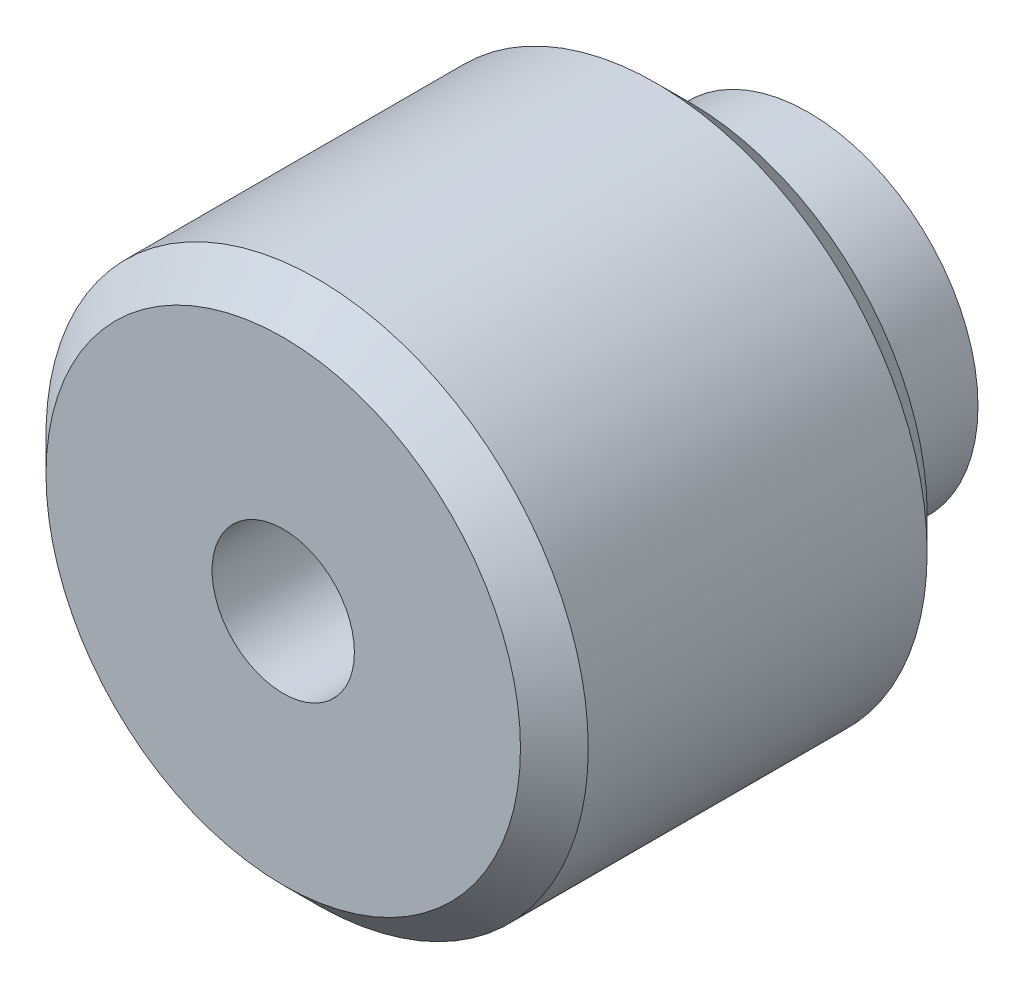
ISO-10303-21;
HEADER;
FILE_DESCRIPTION(('STEP AP214'),'2;1');
FILE_NAME('part.step','',(''),(''),'','','');
FILE_SCHEMA(('AUTOMOTIVE_DESIGN { 1 0 10303 214 1 1 1 1 }'));
ENDSEC;
DATA;
#1=APPLICATION_CONTEXT('core data for automotive mechanical design processes');
#2=APPLICATION_PROTOCOL_DEFINITION('international standard','automotive_design',2000,#1);
#3=PRODUCT_CONTEXT('',#1,'mechanical');
#4=PRODUCT('Part','Part','',(#3));
#5=PRODUCT_RELATED_PRODUCT_CATEGORY('part','',(#4));
#6=PRODUCT_DEFINITION_FORMATION('','',#4);
#7=PRODUCT_DEFINITION_CONTEXT('part definition',#1,'design');
#8=PRODUCT_DEFINITION('design','',#6,#7);
#9=PRODUCT_DEFINITION_SHAPE('','',#8);
#10=(LENGTH_UNIT() NAMED_UNIT(*) SI_UNIT(.MILLI.,.METRE.));
#11=(NAMED_UNIT(*) PLANE_ANGLE_UNIT() SI_UNIT($,.RADIAN.));
#12=(NAMED_UNIT(*) SI_UNIT($,.STERADIAN.) SOLID_ANGLE_UNIT());
#13=UNCERTAINTY_MEASURE_WITH_UNIT(LENGTH_MEASURE(1.E-05),#10,'distance_accuracy_value','');
#14=(GEOMETRIC_REPRESENTATION_CONTEXT(3) GLOBAL_UNCERTAINTY_ASSIGNED_CONTEXT((#13)) GLOBAL_UNIT_ASSIGNED_CONTEXT((#10,
#11,#12)) REPRESENTATION_CONTEXT('',''));
#15=CARTESIAN_POINT('',(0.,0.,0.));
#16=DIRECTION('',(0.,0.,1.));
#17=DIRECTION('',(1.,0.,0.));
#18=AXIS2_PLACEMENT_3D('',#15,#16,#17);
#19=CARTESIAN_POINT('',(0.,0.,0.));
#20=DIRECTION('',(0.,0.,1.));
#21=DIRECTION('',(1.,0.,0.));
#22=AXIS2_PLACEMENT_3D('',#19,#20,#21);
#23=PLANE('',#22);
#24=CARTESIAN_POINT('',(0.,0.,0.));
#25=DIRECTION('',(0.,0.,1.));
#26=DIRECTION('',(1.,0.,0.));
#27=AXIS2_PLACEMENT_3D('',#24,#25,#26);
#28=CIRCLE('',#27,7.);
#29=CARTESIAN_POINT('',(7.,0.,0.));
#30=VERTEX_POINT('',#29);
#31=EDGE_CURVE('E10',#30,#30,#28,.F.);
#32=ORIENTED_EDGE('',*,*,#31,.T.);
#33=EDGE_LOOP('',(#32));
#34=FACE_BOUND('',#33,.T.);
#35=CARTESIAN_POINT('',(0.,0.,0.));
#36=DIRECTION('',(0.,0.,1.));
#37=DIRECTION('',(1.,0.,0.));
#38=AXIS2_PLACEMENT_3D('',#35,#36,#37);
#39=CIRCLE('',#38,5.);
#40=CARTESIAN_POINT('',(5.,0.,0.));
#41=VERTEX_POINT('',#40);
#42=EDGE_CURVE('E51',#41,#41,#39,.F.);
#43=ORIENTED_EDGE('',*,*,#42,.F.);
#44=EDGE_LOOP('',(#43));
#45=FACE_BOUND('',#44,.T.);
#46=ADVANCED_FACE('F31',(#34,#45),#23,.F.);
#47=CARTESIAN_POINT('',(0.,0.,12.));
#48=DIRECTION('',(0.,0.,-1.));
#49=DIRECTION('',(-1.,0.,0.));
#50=AXIS2_PLACEMENT_3D('',#47,#48,#49);
#51=CYLINDRICAL_SURFACE('',#50,8.);
#52=CARTESIAN_POINT('',(0.,0.,11.));
#53=DIRECTION('',(0.,0.,1.));
#54=DIRECTION('',(1.,0.,0.));
#55=AXIS2_PLACEMENT_3D('',#52,#53,#54);
#56=CIRCLE('',#55,8.);
#57=CARTESIAN_POINT('',(8.,0.,11.));
#58=VERTEX_POINT('',#57);
#59=EDGE_CURVE('E38',#58,#58,#56,.F.);
#60=ORIENTED_EDGE('',*,*,#59,.T.);
#61=EDGE_LOOP('',(#60));
#62=FACE_BOUND('',#61,.T.);
#63=CARTESIAN_POINT('',(0.,0.,0.999999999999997));
#64=DIRECTION('',(0.,0.,1.));
#65=DIRECTION('',(1.,0.,0.));
#66=AXIS2_PLACEMENT_3D('',#63,#64,#65);
#67=CIRCLE('',#66,8.);
#68=CARTESIAN_POINT('',(8.,0.,0.999999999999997));
#69=VERTEX_POINT('',#68);
#70=EDGE_CURVE('E42',#69,#69,#67,.T.);
#71=ORIENTED_EDGE('',*,*,#70,.T.);
#72=EDGE_LOOP('',(#71));
#73=FACE_BOUND('',#72,.T.);
#74=ADVANCED_FACE('F70',(#62,#73),#51,.T.);
#75=CARTESIAN_POINT('',(0.,0.,12.));
#76=DIRECTION('',(0.,0.,1.));
#77=DIRECTION('',(1.,0.,0.));
#78=AXIS2_PLACEMENT_3D('',#75,#76,#77);
#79=PLANE('',#78);
#80=CARTESIAN_POINT('',(0.,0.,12.));
#81=DIRECTION('',(0.,0.,1.));
#82=DIRECTION('',(1.,0.,0.));
#83=AXIS2_PLACEMENT_3D('',#80,#81,#82);
#84=CIRCLE('',#83,2.09999999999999);
#85=CARTESIAN_POINT('',(2.09999999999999,0.,12.));
#86=VERTEX_POINT('',#85);
#87=EDGE_CURVE('E60',#86,#86,#84,.T.);
#88=ORIENTED_EDGE('',*,*,#87,.F.);
#89=EDGE_LOOP('',(#88));
#90=FACE_BOUND('',#89,.T.);
#91=CARTESIAN_POINT('',(0.,0.,12.));
#92=DIRECTION('',(0.,0.,1.));
#93=DIRECTION('',(1.,0.,0.));
#94=AXIS2_PLACEMENT_3D('',#91,#92,#93);
#95=CIRCLE('',#94,7.00000000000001);
#96=CARTESIAN_POINT('',(7.00000000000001,0.,12.));
#97=VERTEX_POINT('',#96);
#98=EDGE_CURVE('E46',#97,#97,#95,.T.);
#99=ORIENTED_EDGE('',*,*,#98,.T.);
#100=EDGE_LOOP('',(#99));
#101=FACE_BOUND('',#100,.T.);
#102=ADVANCED_FACE('F66',(#90,#101),#79,.T.);
#103=CARTESIAN_POINT('',(0.,0.,-3.5));
#104=DIRECTION('',(0.,0.,1.));
#105=DIRECTION('',(1.,0.,0.));
#106=AXIS2_PLACEMENT_3D('',#103,#104,#105);
#107=CYLINDRICAL_SURFACE('',#106,5.);
#108=CARTESIAN_POINT('',(0.,0.,-3.5));
#109=DIRECTION('',(0.,0.,-1.));
#110=DIRECTION('',(-1.,0.,0.));
#111=AXIS2_PLACEMENT_3D('',#108,#109,#110);
#112=CIRCLE('',#111,5.);
#113=CARTESIAN_POINT('',(-5.,0.,-3.5));
#114=VERTEX_POINT('',#113);
#115=EDGE_CURVE('E54',#114,#114,#112,.T.);
#116=ORIENTED_EDGE('',*,*,#115,.F.);
#117=EDGE_LOOP('',(#116));
#118=FACE_BOUND('',#117,.T.);
#119=ORIENTED_EDGE('',*,*,#42,.T.);
#120=EDGE_LOOP('',(#119));
#121=FACE_BOUND('',#120,.T.);
#122=ADVANCED_FACE('F69',(#118,#121),#107,.T.);
#123=CARTESIAN_POINT('',(0.,0.,-3.5));
#124=DIRECTION('',(0.,0.,-1.));
#125=DIRECTION('',(-1.,0.,0.));
#126=AXIS2_PLACEMENT_3D('',#123,#124,#125);
#127=PLANE('',#126);
#128=CARTESIAN_POINT('',(0.,0.,-3.5));
#129=DIRECTION('',(0.,0.,1.));
#130=DIRECTION('',(1.,0.,0.));
#131=AXIS2_PLACEMENT_3D('',#128,#129,#130);
#132=CIRCLE('',#131,2.1);
#133=CARTESIAN_POINT('',(2.1,0.,-3.5));
#134=VERTEX_POINT('',#133);
#135=EDGE_CURVE('E57',#134,#134,#132,.T.);
#136=ORIENTED_EDGE('',*,*,#135,.T.);
#137=EDGE_LOOP('',(#136));
#138=FACE_BOUND('',#137,.T.);
#139=ORIENTED_EDGE('',*,*,#115,.T.);
#140=EDGE_LOOP('',(#139));
#141=FACE_BOUND('',#140,.T.);
#142=ADVANCED_FACE('F76',(#138,#141),#127,.T.);
#143=CARTESIAN_POINT('',(0.,0.,12.));
#144=DIRECTION('',(0.,0.,-1.));
#145=DIRECTION('',(-1.,0.,0.));
#146=AXIS2_PLACEMENT_3D('',#143,#144,#145);
#147=CONICAL_SURFACE('',#146,7.00000000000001,0.785398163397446);
#148=ORIENTED_EDGE('',*,*,#59,.F.);
#149=EDGE_LOOP('',(#148));
#150=FACE_BOUND('',#149,.T.);
#151=ORIENTED_EDGE('',*,*,#98,.F.);
#152=EDGE_LOOP('',(#151));
#153=FACE_BOUND('',#152,.T.);
#154=ADVANCED_FACE('F74',(#150,#153),#147,.T.);
#155=CARTESIAN_POINT('',(0.,0.,0.999999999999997));
#156=DIRECTION('',(0.,0.,1.));
#157=DIRECTION('',(1.,0.,0.));
#158=AXIS2_PLACEMENT_3D('',#155,#156,#157);
#159=CONICAL_SURFACE('',#158,8.,0.785398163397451);
#160=ORIENTED_EDGE('',*,*,#31,.F.);
#161=EDGE_LOOP('',(#160));
#162=FACE_BOUND('',#161,.T.);
#163=ORIENTED_EDGE('',*,*,#70,.F.);
#164=EDGE_LOOP('',(#163));
#165=FACE_BOUND('',#164,.T.);
#166=ADVANCED_FACE('F33',(#162,#165),#159,.T.);
#167=CARTESIAN_POINT('',(0.,0.,12.));
#168=DIRECTION('',(0.,0.,1.));
#169=DIRECTION('',(1.,0.,0.));
#170=AXIS2_PLACEMENT_3D('',#167,#168,#169);
#171=CYLINDRICAL_SURFACE('',#170,2.09999999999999);
#172=ORIENTED_EDGE('',*,*,#135,.F.);
#173=EDGE_LOOP('',(#172));
#174=FACE_BOUND('',#173,.T.);
#175=ORIENTED_EDGE('',*,*,#87,.T.);
#176=EDGE_LOOP('',(#175));
#177=FACE_BOUND('',#176,.T.);
#178=ADVANCED_FACE('F64',(#174,#177),#171,.F.);
#179=CLOSED_SHELL('',(#46,#74,#102,#122,#142,#154,#166,#178));
#180=MANIFOLD_SOLID_BREP('B2',#179);
#181=ADVANCED_BREP_SHAPE_REPRESENTATION('',(#18,#180),#14);
#182=SHAPE_DEFINITION_REPRESENTATION(#9,#181);
ENDSEC;
END-ISO-10303-21;
